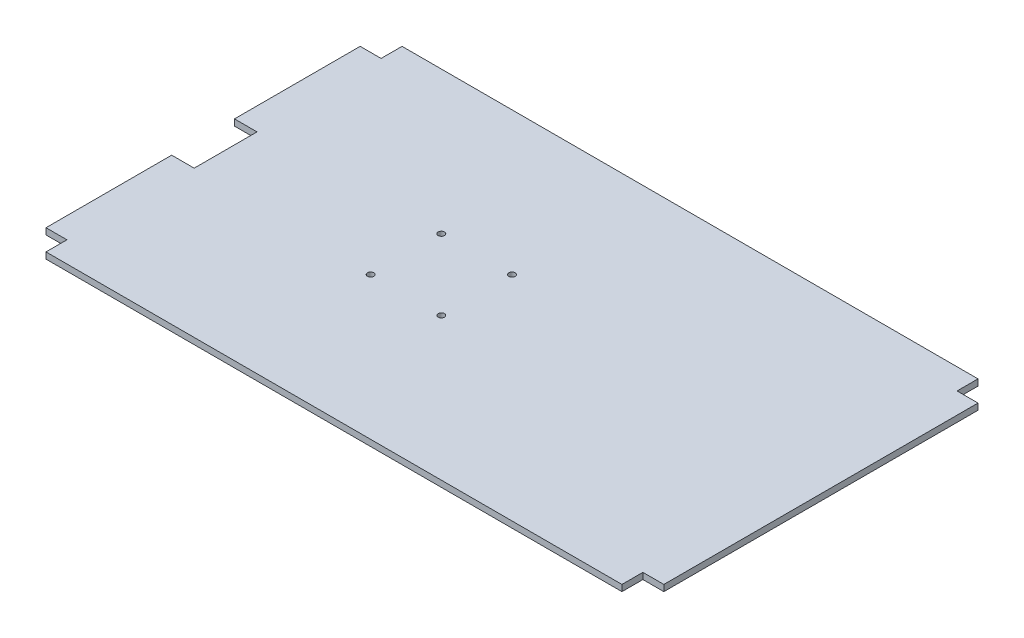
ISO-10303-21;
HEADER;
FILE_DESCRIPTION(('STEP AP214'),'2;1');
FILE_NAME('part.step','',(''),(''),'','','');
FILE_SCHEMA(('AUTOMOTIVE_DESIGN { 1 0 10303 214 1 1 1 1 }'));
ENDSEC;
DATA;
#1=APPLICATION_CONTEXT('core data for automotive mechanical design processes');
#2=APPLICATION_PROTOCOL_DEFINITION('international standard','automotive_design',2000,#1);
#3=PRODUCT_CONTEXT('',#1,'mechanical');
#4=PRODUCT('Part','Part','',(#3));
#5=PRODUCT_RELATED_PRODUCT_CATEGORY('part','',(#4));
#6=PRODUCT_DEFINITION_FORMATION('','',#4);
#7=PRODUCT_DEFINITION_CONTEXT('part definition',#1,'design');
#8=PRODUCT_DEFINITION('design','',#6,#7);
#9=PRODUCT_DEFINITION_SHAPE('','',#8);
#10=(LENGTH_UNIT() NAMED_UNIT(*) SI_UNIT(.MILLI.,.METRE.));
#11=(NAMED_UNIT(*) PLANE_ANGLE_UNIT() SI_UNIT($,.RADIAN.));
#12=(NAMED_UNIT(*) SI_UNIT($,.STERADIAN.) SOLID_ANGLE_UNIT());
#13=UNCERTAINTY_MEASURE_WITH_UNIT(LENGTH_MEASURE(1.E-05),#10,'distance_accuracy_value','');
#14=(GEOMETRIC_REPRESENTATION_CONTEXT(3) GLOBAL_UNCERTAINTY_ASSIGNED_CONTEXT((#13)) GLOBAL_UNIT_ASSIGNED_CONTEXT((#10,
#11,#12)) REPRESENTATION_CONTEXT('',''));
#15=CARTESIAN_POINT('',(0.,0.,0.));
#16=DIRECTION('',(0.,0.,1.));
#17=DIRECTION('',(1.,0.,0.));
#18=AXIS2_PLACEMENT_3D('',#15,#16,#17);
#19=CARTESIAN_POINT('',(-590.,6.,300.));
#20=DIRECTION('',(1.,0.,0.));
#21=DIRECTION('',(0.,0.,-1.));
#22=AXIS2_PLACEMENT_3D('',#19,#20,#21);
#23=PLANE('',#22);
#24=DIRECTION('',(0.,0.,1.));
#25=VECTOR('',#24,1.);
#26=CARTESIAN_POINT('',(-590.,-6.,300.));
#27=LINE('',#26,#25);
#28=CARTESIAN_POINT('',(-590.,-6.,-300.));
#29=VERTEX_POINT('',#28);
#30=CARTESIAN_POINT('',(-590.,-6.,-60.0000000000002));
#31=VERTEX_POINT('',#30);
#32=EDGE_CURVE('E193',#29,#31,#27,.T.);
#33=ORIENTED_EDGE('',*,*,#32,.T.);
#34=DIRECTION('',(0.,1.,0.));
#35=VECTOR('',#34,1.);
#36=CARTESIAN_POINT('',(-590.,-6.001,-60.0000000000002));
#37=LINE('',#36,#35);
#38=CARTESIAN_POINT('',(-590.,6.,-60.0000000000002));
#39=VERTEX_POINT('',#38);
#40=EDGE_CURVE('E269',#31,#39,#37,.T.);
#41=ORIENTED_EDGE('',*,*,#40,.T.);
#42=DIRECTION('',(0.,0.,1.));
#43=VECTOR('',#42,1.);
#44=CARTESIAN_POINT('',(-590.,6.,300.));
#45=LINE('',#44,#43);
#46=CARTESIAN_POINT('',(-590.,6.,-300.));
#47=VERTEX_POINT('',#46);
#48=EDGE_CURVE('E156',#47,#39,#45,.T.);
#49=ORIENTED_EDGE('',*,*,#48,.F.);
#50=DIRECTION('',(0.,-1.,0.));
#51=VECTOR('',#50,1.);
#52=CARTESIAN_POINT('',(-590.,6.,-300.));
#53=LINE('',#52,#51);
#54=EDGE_CURVE('E204',#47,#29,#53,.T.);
#55=ORIENTED_EDGE('',*,*,#54,.T.);
#56=EDGE_LOOP('',(#33,#41,#49,#55));
#57=FACE_BOUND('',#56,.T.);
#58=ADVANCED_FACE('F39',(#57),#23,.F.);
#59=CARTESIAN_POINT('',(550.,6.,340.));
#60=DIRECTION('',(-1.,0.,0.));
#61=DIRECTION('',(0.,0.,1.));
#62=AXIS2_PLACEMENT_3D('',#59,#60,#61);
#63=PLANE('',#62);
#64=DIRECTION('',(0.,0.,-1.));
#65=VECTOR('',#64,1.);
#66=CARTESIAN_POINT('',(550.,-6.,340.));
#67=LINE('',#66,#65);
#68=CARTESIAN_POINT('',(550.,-6.,340.));
#69=VERTEX_POINT('',#68);
#70=CARTESIAN_POINT('',(550.,-6.,300.));
#71=VERTEX_POINT('',#70);
#72=EDGE_CURVE('E174',#69,#71,#67,.T.);
#73=ORIENTED_EDGE('',*,*,#72,.T.);
#74=DIRECTION('',(0.,-1.,0.));
#75=VECTOR('',#74,1.);
#76=CARTESIAN_POINT('',(550.,6.,300.));
#77=LINE('',#76,#75);
#78=CARTESIAN_POINT('',(550.,6.,300.));
#79=VERTEX_POINT('',#78);
#80=EDGE_CURVE('E11',#79,#71,#77,.T.);
#81=ORIENTED_EDGE('',*,*,#80,.F.);
#82=DIRECTION('',(0.,0.,-1.));
#83=VECTOR('',#82,1.);
#84=CARTESIAN_POINT('',(550.,6.,340.));
#85=LINE('',#84,#83);
#86=CARTESIAN_POINT('',(550.,6.,340.));
#87=VERTEX_POINT('',#86);
#88=EDGE_CURVE('E200',#87,#79,#85,.T.);
#89=ORIENTED_EDGE('',*,*,#88,.F.);
#90=DIRECTION('',(0.,-1.,0.));
#91=VECTOR('',#90,1.);
#92=CARTESIAN_POINT('',(550.,6.,340.));
#93=LINE('',#92,#91);
#94=EDGE_CURVE('E170',#87,#69,#93,.T.);
#95=ORIENTED_EDGE('',*,*,#94,.T.);
#96=EDGE_LOOP('',(#73,#81,#89,#95));
#97=FACE_BOUND('',#96,.T.);
#98=ADVANCED_FACE('F41',(#97),#63,.F.);
#99=CARTESIAN_POINT('',(590.,6.,300.));
#100=DIRECTION('',(0.,0.,-1.));
#101=DIRECTION('',(-1.,0.,0.));
#102=AXIS2_PLACEMENT_3D('',#99,#100,#101);
#103=PLANE('',#102);
#104=DIRECTION('',(1.,0.,0.));
#105=VECTOR('',#104,1.);
#106=CARTESIAN_POINT('',(590.,-6.,300.));
#107=LINE('',#106,#105);
#108=CARTESIAN_POINT('',(590.,-6.,300.));
#109=VERTEX_POINT('',#108);
#110=EDGE_CURVE('E177',#71,#109,#107,.T.);
#111=ORIENTED_EDGE('',*,*,#110,.T.);
#112=DIRECTION('',(0.,-1.,0.));
#113=VECTOR('',#112,1.);
#114=CARTESIAN_POINT('',(590.,6.,300.));
#115=LINE('',#114,#113);
#116=CARTESIAN_POINT('',(590.,6.,300.));
#117=VERTEX_POINT('',#116);
#118=EDGE_CURVE('E47',#117,#109,#115,.T.);
#119=ORIENTED_EDGE('',*,*,#118,.F.);
#120=DIRECTION('',(1.,0.,0.));
#121=VECTOR('',#120,1.);
#122=CARTESIAN_POINT('',(590.,6.,300.));
#123=LINE('',#122,#121);
#124=EDGE_CURVE('E116',#79,#117,#123,.T.);
#125=ORIENTED_EDGE('',*,*,#124,.F.);
#126=ORIENTED_EDGE('',*,*,#80,.T.);
#127=EDGE_LOOP('',(#111,#119,#125,#126));
#128=FACE_BOUND('',#127,.T.);
#129=ADVANCED_FACE('F291',(#128),#103,.F.);
#130=CARTESIAN_POINT('',(590.,6.,300.));
#131=DIRECTION('',(-1.,0.,0.));
#132=DIRECTION('',(0.,0.,1.));
#133=AXIS2_PLACEMENT_3D('',#130,#131,#132);
#134=PLANE('',#133);
#135=DIRECTION('',(0.,0.,-1.));
#136=VECTOR('',#135,1.);
#137=CARTESIAN_POINT('',(590.,-6.,300.));
#138=LINE('',#137,#136);
#139=CARTESIAN_POINT('',(590.,-6.,-300.));
#140=VERTEX_POINT('',#139);
#141=EDGE_CURVE('E180',#109,#140,#138,.T.);
#142=ORIENTED_EDGE('',*,*,#141,.T.);
#143=DIRECTION('',(0.,-1.,0.));
#144=VECTOR('',#143,1.);
#145=CARTESIAN_POINT('',(590.,6.,-300.));
#146=LINE('',#145,#144);
#147=CARTESIAN_POINT('',(590.,6.,-300.));
#148=VERTEX_POINT('',#147);
#149=EDGE_CURVE('E219',#148,#140,#146,.T.);
#150=ORIENTED_EDGE('',*,*,#149,.F.);
#151=DIRECTION('',(0.,0.,-1.));
#152=VECTOR('',#151,1.);
#153=CARTESIAN_POINT('',(590.,6.,300.));
#154=LINE('',#153,#152);
#155=EDGE_CURVE('E227',#117,#148,#154,.T.);
#156=ORIENTED_EDGE('',*,*,#155,.F.);
#157=ORIENTED_EDGE('',*,*,#118,.T.);
#158=EDGE_LOOP('',(#142,#150,#156,#157));
#159=FACE_BOUND('',#158,.T.);
#160=ADVANCED_FACE('F225',(#159),#134,.F.);
#161=CARTESIAN_POINT('',(590.,6.,-300.));
#162=DIRECTION('',(0.,0.,1.));
#163=DIRECTION('',(1.,0.,0.));
#164=AXIS2_PLACEMENT_3D('',#161,#162,#163);
#165=PLANE('',#164);
#166=DIRECTION('',(-1.,0.,0.));
#167=VECTOR('',#166,1.);
#168=CARTESIAN_POINT('',(590.,-6.,-300.));
#169=LINE('',#168,#167);
#170=CARTESIAN_POINT('',(550.,-6.,-300.));
#171=VERTEX_POINT('',#170);
#172=EDGE_CURVE('E182',#140,#171,#169,.T.);
#173=ORIENTED_EDGE('',*,*,#172,.T.);
#174=DIRECTION('',(0.,-1.,0.));
#175=VECTOR('',#174,1.);
#176=CARTESIAN_POINT('',(550.,6.,-300.));
#177=LINE('',#176,#175);
#178=CARTESIAN_POINT('',(550.,6.,-300.));
#179=VERTEX_POINT('',#178);
#180=EDGE_CURVE('E216',#179,#171,#177,.T.);
#181=ORIENTED_EDGE('',*,*,#180,.F.);
#182=DIRECTION('',(-1.,0.,0.));
#183=VECTOR('',#182,1.);
#184=CARTESIAN_POINT('',(590.,6.,-300.));
#185=LINE('',#184,#183);
#186=EDGE_CURVE('E245',#148,#179,#185,.T.);
#187=ORIENTED_EDGE('',*,*,#186,.F.);
#188=ORIENTED_EDGE('',*,*,#149,.T.);
#189=EDGE_LOOP('',(#173,#181,#187,#188));
#190=FACE_BOUND('',#189,.T.);
#191=ADVANCED_FACE('F236',(#190),#165,.F.);
#192=CARTESIAN_POINT('',(550.,6.,-340.));
#193=DIRECTION('',(-1.,0.,0.));
#194=DIRECTION('',(0.,0.,1.));
#195=AXIS2_PLACEMENT_3D('',#192,#193,#194);
#196=PLANE('',#195);
#197=DIRECTION('',(0.,0.,-1.));
#198=VECTOR('',#197,1.);
#199=CARTESIAN_POINT('',(550.,-6.,-340.));
#200=LINE('',#199,#198);
#201=CARTESIAN_POINT('',(550.,-6.,-340.));
#202=VERTEX_POINT('',#201);
#203=EDGE_CURVE('E184',#171,#202,#200,.T.);
#204=ORIENTED_EDGE('',*,*,#203,.T.);
#205=DIRECTION('',(0.,-1.,0.));
#206=VECTOR('',#205,1.);
#207=CARTESIAN_POINT('',(550.,6.,-340.));
#208=LINE('',#207,#206);
#209=CARTESIAN_POINT('',(550.,6.,-340.));
#210=VERTEX_POINT('',#209);
#211=EDGE_CURVE('E213',#210,#202,#208,.T.);
#212=ORIENTED_EDGE('',*,*,#211,.F.);
#213=DIRECTION('',(0.,0.,-1.));
#214=VECTOR('',#213,1.);
#215=CARTESIAN_POINT('',(550.,6.,-340.));
#216=LINE('',#215,#214);
#217=EDGE_CURVE('E242',#179,#210,#216,.T.);
#218=ORIENTED_EDGE('',*,*,#217,.F.);
#219=ORIENTED_EDGE('',*,*,#180,.T.);
#220=EDGE_LOOP('',(#204,#212,#218,#219));
#221=FACE_BOUND('',#220,.T.);
#222=ADVANCED_FACE('F240',(#221),#196,.F.);
#223=CARTESIAN_POINT('',(-550.,6.,-340.));
#224=DIRECTION('',(0.,0.,1.));
#225=DIRECTION('',(1.,0.,0.));
#226=AXIS2_PLACEMENT_3D('',#223,#224,#225);
#227=PLANE('',#226);
#228=DIRECTION('',(-1.,0.,0.));
#229=VECTOR('',#228,1.);
#230=CARTESIAN_POINT('',(-550.,-6.,-340.));
#231=LINE('',#230,#229);
#232=CARTESIAN_POINT('',(-550.,-6.,-340.));
#233=VERTEX_POINT('',#232);
#234=EDGE_CURVE('E186',#202,#233,#231,.T.);
#235=ORIENTED_EDGE('',*,*,#234,.T.);
#236=DIRECTION('',(0.,-1.,0.));
#237=VECTOR('',#236,1.);
#238=CARTESIAN_POINT('',(-550.,6.,-340.));
#239=LINE('',#238,#237);
#240=CARTESIAN_POINT('',(-550.,6.,-340.));
#241=VERTEX_POINT('',#240);
#242=EDGE_CURVE('E210',#241,#233,#239,.T.);
#243=ORIENTED_EDGE('',*,*,#242,.F.);
#244=DIRECTION('',(-1.,0.,0.));
#245=VECTOR('',#244,1.);
#246=CARTESIAN_POINT('',(-550.,6.,-340.));
#247=LINE('',#246,#245);
#248=EDGE_CURVE('E244',#210,#241,#247,.T.);
#249=ORIENTED_EDGE('',*,*,#248,.F.);
#250=ORIENTED_EDGE('',*,*,#211,.T.);
#251=EDGE_LOOP('',(#235,#243,#249,#250));
#252=FACE_BOUND('',#251,.T.);
#253=ADVANCED_FACE('F510',(#252),#227,.F.);
#254=CARTESIAN_POINT('',(-550.,6.,-340.));
#255=DIRECTION('',(1.,0.,0.));
#256=DIRECTION('',(0.,0.,-1.));
#257=AXIS2_PLACEMENT_3D('',#254,#255,#256);
#258=PLANE('',#257);
#259=DIRECTION('',(0.,0.,1.));
#260=VECTOR('',#259,1.);
#261=CARTESIAN_POINT('',(-550.,-6.,-340.));
#262=LINE('',#261,#260);
#263=CARTESIAN_POINT('',(-550.,-6.,-300.));
#264=VERTEX_POINT('',#263);
#265=EDGE_CURVE('E188',#233,#264,#262,.T.);
#266=ORIENTED_EDGE('',*,*,#265,.T.);
#267=DIRECTION('',(0.,-1.,0.));
#268=VECTOR('',#267,1.);
#269=CARTESIAN_POINT('',(-550.,6.,-300.));
#270=LINE('',#269,#268);
#271=CARTESIAN_POINT('',(-550.,6.,-300.));
#272=VERTEX_POINT('',#271);
#273=EDGE_CURVE('E207',#272,#264,#270,.T.);
#274=ORIENTED_EDGE('',*,*,#273,.F.);
#275=DIRECTION('',(0.,0.,1.));
#276=VECTOR('',#275,1.);
#277=CARTESIAN_POINT('',(-550.,6.,-340.));
#278=LINE('',#277,#276);
#279=EDGE_CURVE('E247',#241,#272,#278,.T.);
#280=ORIENTED_EDGE('',*,*,#279,.F.);
#281=ORIENTED_EDGE('',*,*,#242,.T.);
#282=EDGE_LOOP('',(#266,#274,#280,#281));
#283=FACE_BOUND('',#282,.T.);
#284=ADVANCED_FACE('F314',(#283),#258,.F.);
#285=CARTESIAN_POINT('',(-590.,6.,-300.));
#286=DIRECTION('',(0.,0.,1.));
#287=DIRECTION('',(1.,0.,0.));
#288=AXIS2_PLACEMENT_3D('',#285,#286,#287);
#289=PLANE('',#288);
#290=DIRECTION('',(-1.,0.,0.));
#291=VECTOR('',#290,1.);
#292=CARTESIAN_POINT('',(-590.,-6.,-300.));
#293=LINE('',#292,#291);
#294=EDGE_CURVE('E190',#264,#29,#293,.T.);
#295=ORIENTED_EDGE('',*,*,#294,.T.);
#296=ORIENTED_EDGE('',*,*,#54,.F.);
#297=DIRECTION('',(-1.,0.,0.));
#298=VECTOR('',#297,1.);
#299=CARTESIAN_POINT('',(-590.,6.,-300.));
#300=LINE('',#299,#298);
#301=EDGE_CURVE('E253',#272,#47,#300,.T.);
#302=ORIENTED_EDGE('',*,*,#301,.F.);
#303=ORIENTED_EDGE('',*,*,#273,.T.);
#304=EDGE_LOOP('',(#295,#296,#302,#303));
#305=FACE_BOUND('',#304,.T.);
#306=ADVANCED_FACE('F307',(#305),#289,.F.);
#307=CARTESIAN_POINT('',(-590.,6.,59.9999999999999));
#308=VERTEX_POINT('',#307);
#309=CARTESIAN_POINT('',(-590.,6.,300.));
#310=VERTEX_POINT('',#309);
#311=EDGE_CURVE('E152',#308,#310,#45,.T.);
#312=ORIENTED_EDGE('',*,*,#311,.F.);
#313=DIRECTION('',(0.,1.,0.));
#314=VECTOR('',#313,1.);
#315=CARTESIAN_POINT('',(-590.,-6.001,59.9999999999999));
#316=LINE('',#315,#314);
#317=CARTESIAN_POINT('',(-590.,-6.,59.9999999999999));
#318=VERTEX_POINT('',#317);
#319=EDGE_CURVE('E284',#318,#308,#316,.T.);
#320=ORIENTED_EDGE('',*,*,#319,.F.);
#321=CARTESIAN_POINT('',(-590.,-6.,300.));
#322=VERTEX_POINT('',#321);
#323=EDGE_CURVE('E192',#318,#322,#27,.T.);
#324=ORIENTED_EDGE('',*,*,#323,.T.);
#325=DIRECTION('',(0.,-1.,0.));
#326=VECTOR('',#325,1.);
#327=CARTESIAN_POINT('',(-590.,6.,300.));
#328=LINE('',#327,#326);
#329=EDGE_CURVE('E165',#310,#322,#328,.T.);
#330=ORIENTED_EDGE('',*,*,#329,.F.);
#331=EDGE_LOOP('',(#312,#320,#324,#330));
#332=FACE_BOUND('',#331,.T.);
#333=ADVANCED_FACE('F300',(#332),#23,.F.);
#334=CARTESIAN_POINT('',(-590.,6.,300.));
#335=DIRECTION('',(0.,0.,-1.));
#336=DIRECTION('',(-1.,0.,0.));
#337=AXIS2_PLACEMENT_3D('',#334,#335,#336);
#338=PLANE('',#337);
#339=DIRECTION('',(1.,0.,0.));
#340=VECTOR('',#339,1.);
#341=CARTESIAN_POINT('',(-590.,-6.,300.));
#342=LINE('',#341,#340);
#343=CARTESIAN_POINT('',(-550.,-6.,300.));
#344=VERTEX_POINT('',#343);
#345=EDGE_CURVE('E162',#322,#344,#342,.T.);
#346=ORIENTED_EDGE('',*,*,#345,.T.);
#347=DIRECTION('',(0.,-1.,0.));
#348=VECTOR('',#347,1.);
#349=CARTESIAN_POINT('',(-550.,6.,300.));
#350=LINE('',#349,#348);
#351=CARTESIAN_POINT('',(-550.,6.,300.));
#352=VERTEX_POINT('',#351);
#353=EDGE_CURVE('E159',#352,#344,#350,.T.);
#354=ORIENTED_EDGE('',*,*,#353,.F.);
#355=DIRECTION('',(1.,0.,0.));
#356=VECTOR('',#355,1.);
#357=CARTESIAN_POINT('',(-590.,6.,300.));
#358=LINE('',#357,#356);
#359=EDGE_CURVE('E143',#310,#352,#358,.T.);
#360=ORIENTED_EDGE('',*,*,#359,.F.);
#361=ORIENTED_EDGE('',*,*,#329,.T.);
#362=EDGE_LOOP('',(#346,#354,#360,#361));
#363=FACE_BOUND('',#362,.T.);
#364=ADVANCED_FACE('F160',(#363),#338,.F.);
#365=CARTESIAN_POINT('',(-550.,6.,340.));
#366=DIRECTION('',(1.,0.,0.));
#367=DIRECTION('',(0.,0.,-1.));
#368=AXIS2_PLACEMENT_3D('',#365,#366,#367);
#369=PLANE('',#368);
#370=DIRECTION('',(0.,0.,1.));
#371=VECTOR('',#370,1.);
#372=CARTESIAN_POINT('',(-550.,-6.,340.));
#373=LINE('',#372,#371);
#374=CARTESIAN_POINT('',(-550.,-6.,340.));
#375=VERTEX_POINT('',#374);
#376=EDGE_CURVE('E197',#344,#375,#373,.T.);
#377=ORIENTED_EDGE('',*,*,#376,.T.);
#378=DIRECTION('',(0.,-1.,0.));
#379=VECTOR('',#378,1.);
#380=CARTESIAN_POINT('',(-550.,6.,340.));
#381=LINE('',#380,#379);
#382=CARTESIAN_POINT('',(-550.,6.,340.));
#383=VERTEX_POINT('',#382);
#384=EDGE_CURVE('E166',#383,#375,#381,.T.);
#385=ORIENTED_EDGE('',*,*,#384,.F.);
#386=DIRECTION('',(0.,0.,1.));
#387=VECTOR('',#386,1.);
#388=CARTESIAN_POINT('',(-550.,6.,340.));
#389=LINE('',#388,#387);
#390=EDGE_CURVE('E148',#352,#383,#389,.T.);
#391=ORIENTED_EDGE('',*,*,#390,.F.);
#392=ORIENTED_EDGE('',*,*,#353,.T.);
#393=EDGE_LOOP('',(#377,#385,#391,#392));
#394=FACE_BOUND('',#393,.T.);
#395=ADVANCED_FACE('F168',(#394),#369,.F.);
#396=CARTESIAN_POINT('',(-550.,6.,340.));
#397=DIRECTION('',(0.,0.,-1.));
#398=DIRECTION('',(-1.,0.,0.));
#399=AXIS2_PLACEMENT_3D('',#396,#397,#398);
#400=PLANE('',#399);
#401=DIRECTION('',(1.,0.,0.));
#402=VECTOR('',#401,1.);
#403=CARTESIAN_POINT('',(-550.,-6.,340.));
#404=LINE('',#403,#402);
#405=EDGE_CURVE('E108',#375,#69,#404,.T.);
#406=ORIENTED_EDGE('',*,*,#405,.T.);
#407=ORIENTED_EDGE('',*,*,#94,.F.);
#408=DIRECTION('',(1.,0.,0.));
#409=VECTOR('',#408,1.);
#410=CARTESIAN_POINT('',(-550.,6.,340.));
#411=LINE('',#410,#409);
#412=EDGE_CURVE('E63',#383,#87,#411,.T.);
#413=ORIENTED_EDGE('',*,*,#412,.F.);
#414=ORIENTED_EDGE('',*,*,#384,.T.);
#415=EDGE_LOOP('',(#406,#407,#413,#414));
#416=FACE_BOUND('',#415,.T.);
#417=ADVANCED_FACE('F358',(#416),#400,.F.);
#418=CARTESIAN_POINT('',(0.,6.,0.));
#419=DIRECTION('',(0.,1.,0.));
#420=DIRECTION('',(0.,0.,1.));
#421=AXIS2_PLACEMENT_3D('',#418,#419,#420);
#422=PLANE('',#421);
#423=CARTESIAN_POINT('',(-202.500015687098,6.,-67.5000000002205));
#424=DIRECTION('',(0.,1.,0.));
#425=DIRECTION('',(0.,0.,1.));
#426=AXIS2_PLACEMENT_3D('',#423,#424,#425);
#427=CIRCLE('',#426,6.00000000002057);
#428=CARTESIAN_POINT('',(-202.500015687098,6.,-61.5000000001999));
#429=VERTEX_POINT('',#428);
#430=EDGE_CURVE('E451',#429,#429,#427,.T.);
#431=ORIENTED_EDGE('',*,*,#430,.F.);
#432=EDGE_LOOP('',(#431));
#433=FACE_BOUND('',#432,.T.);
#434=CARTESIAN_POINT('',(-67.500015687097,6.,67.4999999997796));
#435=DIRECTION('',(0.,1.,0.));
#436=DIRECTION('',(0.,0.,1.));
#437=AXIS2_PLACEMENT_3D('',#434,#435,#436);
#438=CIRCLE('',#437,6.0000000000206);
#439=CARTESIAN_POINT('',(-67.500015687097,6.,73.4999999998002));
#440=VERTEX_POINT('',#439);
#441=EDGE_CURVE('E461',#440,#440,#438,.T.);
#442=ORIENTED_EDGE('',*,*,#441,.F.);
#443=EDGE_LOOP('',(#442));
#444=FACE_BOUND('',#443,.T.);
#445=CARTESIAN_POINT('',(-67.500015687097,6.,-67.5000000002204));
#446=DIRECTION('',(0.,1.,0.));
#447=DIRECTION('',(0.,0.,1.));
#448=AXIS2_PLACEMENT_3D('',#445,#446,#447);
#449=CIRCLE('',#448,6.0000000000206);
#450=CARTESIAN_POINT('',(-67.500015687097,6.,-61.5000000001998));
#451=VERTEX_POINT('',#450);
#452=EDGE_CURVE('E476',#451,#451,#449,.T.);
#453=ORIENTED_EDGE('',*,*,#452,.F.);
#454=EDGE_LOOP('',(#453));
#455=FACE_BOUND('',#454,.T.);
#456=CARTESIAN_POINT('',(-202.500015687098,6.,67.4999999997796));
#457=DIRECTION('',(0.,1.,0.));
#458=DIRECTION('',(0.,0.,1.));
#459=AXIS2_PLACEMENT_3D('',#456,#457,#458);
#460=CIRCLE('',#459,6.0000000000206);
#461=CARTESIAN_POINT('',(-202.500015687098,6.,73.4999999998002));
#462=VERTEX_POINT('',#461);
#463=EDGE_CURVE('E338',#462,#462,#460,.T.);
#464=ORIENTED_EDGE('',*,*,#463,.F.);
#465=EDGE_LOOP('',(#464));
#466=FACE_BOUND('',#465,.T.);
#467=DIRECTION('',(-1.,0.,0.));
#468=VECTOR('',#467,1.);
#469=CARTESIAN_POINT('',(-590.,6.,-60.0000000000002));
#470=LINE('',#469,#468);
#471=CARTESIAN_POINT('',(-547.,6.,-60.0000000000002));
#472=VERTEX_POINT('',#471);
#473=EDGE_CURVE('E260',#472,#39,#470,.T.);
#474=ORIENTED_EDGE('',*,*,#473,.F.);
#475=DIRECTION('',(0.,0.,-1.));
#476=VECTOR('',#475,1.);
#477=CARTESIAN_POINT('',(-547.,6.,59.9999999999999));
#478=LINE('',#477,#476);
#479=CARTESIAN_POINT('',(-547.,6.,59.9999999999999));
#480=VERTEX_POINT('',#479);
#481=EDGE_CURVE('E329',#480,#472,#478,.T.);
#482=ORIENTED_EDGE('',*,*,#481,.F.);
#483=DIRECTION('',(1.,0.,0.));
#484=VECTOR('',#483,1.);
#485=CARTESIAN_POINT('',(-590.,6.,59.9999999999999));
#486=LINE('',#485,#484);
#487=EDGE_CURVE('E332',#308,#480,#486,.T.);
#488=ORIENTED_EDGE('',*,*,#487,.F.);
#489=ORIENTED_EDGE('',*,*,#311,.T.);
#490=ORIENTED_EDGE('',*,*,#359,.T.);
#491=ORIENTED_EDGE('',*,*,#390,.T.);
#492=ORIENTED_EDGE('',*,*,#412,.T.);
#493=ORIENTED_EDGE('',*,*,#88,.T.);
#494=ORIENTED_EDGE('',*,*,#124,.T.);
#495=ORIENTED_EDGE('',*,*,#155,.T.);
#496=ORIENTED_EDGE('',*,*,#186,.T.);
#497=ORIENTED_EDGE('',*,*,#217,.T.);
#498=ORIENTED_EDGE('',*,*,#248,.T.);
#499=ORIENTED_EDGE('',*,*,#279,.T.);
#500=ORIENTED_EDGE('',*,*,#301,.T.);
#501=ORIENTED_EDGE('',*,*,#48,.T.);
#502=EDGE_LOOP('',(#474,#482,#488,#489,#490,#491,#492,#493,#494,#495,#496,#497,#498,#499,#500,#501));
#503=FACE_BOUND('',#502,.T.);
#504=ADVANCED_FACE('F146',(#433,#444,#455,#466,#503),#422,.T.);
#505=CARTESIAN_POINT('',(0.,-6.,0.));
#506=DIRECTION('',(0.,1.,0.));
#507=DIRECTION('',(0.,0.,1.));
#508=AXIS2_PLACEMENT_3D('',#505,#506,#507);
#509=PLANE('',#508);
#510=CARTESIAN_POINT('',(-202.500015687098,-6.,-67.5000000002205));
#511=DIRECTION('',(0.,1.,0.));
#512=DIRECTION('',(0.,0.,1.));
#513=AXIS2_PLACEMENT_3D('',#510,#511,#512);
#514=CIRCLE('',#513,6.00000000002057);
#515=CARTESIAN_POINT('',(-202.500015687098,-6.,-61.5000000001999));
#516=VERTEX_POINT('',#515);
#517=EDGE_CURVE('E454',#516,#516,#514,.F.);
#518=ORIENTED_EDGE('',*,*,#517,.F.);
#519=EDGE_LOOP('',(#518));
#520=FACE_BOUND('',#519,.T.);
#521=CARTESIAN_POINT('',(-67.500015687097,-6.,67.4999999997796));
#522=DIRECTION('',(0.,1.,0.));
#523=DIRECTION('',(0.,0.,1.));
#524=AXIS2_PLACEMENT_3D('',#521,#522,#523);
#525=CIRCLE('',#524,6.0000000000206);
#526=CARTESIAN_POINT('',(-67.500015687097,-6.,73.4999999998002));
#527=VERTEX_POINT('',#526);
#528=EDGE_CURVE('E457',#527,#527,#525,.F.);
#529=ORIENTED_EDGE('',*,*,#528,.F.);
#530=EDGE_LOOP('',(#529));
#531=FACE_BOUND('',#530,.T.);
#532=CARTESIAN_POINT('',(-67.500015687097,-6.,-67.5000000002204));
#533=DIRECTION('',(0.,1.,0.));
#534=DIRECTION('',(0.,0.,1.));
#535=AXIS2_PLACEMENT_3D('',#532,#533,#534);
#536=CIRCLE('',#535,6.0000000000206);
#537=CARTESIAN_POINT('',(-67.500015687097,-6.,-61.5000000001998));
#538=VERTEX_POINT('',#537);
#539=EDGE_CURVE('E464',#538,#538,#536,.F.);
#540=ORIENTED_EDGE('',*,*,#539,.F.);
#541=EDGE_LOOP('',(#540));
#542=FACE_BOUND('',#541,.T.);
#543=CARTESIAN_POINT('',(-202.500015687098,-6.,67.4999999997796));
#544=DIRECTION('',(0.,1.,0.));
#545=DIRECTION('',(0.,0.,1.));
#546=AXIS2_PLACEMENT_3D('',#543,#544,#545);
#547=CIRCLE('',#546,6.0000000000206);
#548=CARTESIAN_POINT('',(-202.500015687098,-6.,73.4999999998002));
#549=VERTEX_POINT('',#548);
#550=EDGE_CURVE('E335',#549,#549,#547,.F.);
#551=ORIENTED_EDGE('',*,*,#550,.F.);
#552=EDGE_LOOP('',(#551));
#553=FACE_BOUND('',#552,.T.);
#554=DIRECTION('',(0.,0.,1.));
#555=VECTOR('',#554,1.);
#556=CARTESIAN_POINT('',(-547.,-6.,59.9999999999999));
#557=LINE('',#556,#555);
#558=CARTESIAN_POINT('',(-547.,-6.,-60.0000000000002));
#559=VERTEX_POINT('',#558);
#560=CARTESIAN_POINT('',(-547.,-6.,59.9999999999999));
#561=VERTEX_POINT('',#560);
#562=EDGE_CURVE('E54',#559,#561,#557,.T.);
#563=ORIENTED_EDGE('',*,*,#562,.F.);
#564=DIRECTION('',(1.,0.,0.));
#565=VECTOR('',#564,1.);
#566=CARTESIAN_POINT('',(-590.,-6.,-60.0000000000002));
#567=LINE('',#566,#565);
#568=EDGE_CURVE('E330',#31,#559,#567,.T.);
#569=ORIENTED_EDGE('',*,*,#568,.F.);
#570=ORIENTED_EDGE('',*,*,#32,.F.);
#571=ORIENTED_EDGE('',*,*,#294,.F.);
#572=ORIENTED_EDGE('',*,*,#265,.F.);
#573=ORIENTED_EDGE('',*,*,#234,.F.);
#574=ORIENTED_EDGE('',*,*,#203,.F.);
#575=ORIENTED_EDGE('',*,*,#172,.F.);
#576=ORIENTED_EDGE('',*,*,#141,.F.);
#577=ORIENTED_EDGE('',*,*,#110,.F.);
#578=ORIENTED_EDGE('',*,*,#72,.F.);
#579=ORIENTED_EDGE('',*,*,#405,.F.);
#580=ORIENTED_EDGE('',*,*,#376,.F.);
#581=ORIENTED_EDGE('',*,*,#345,.F.);
#582=ORIENTED_EDGE('',*,*,#323,.F.);
#583=DIRECTION('',(-1.,0.,0.));
#584=VECTOR('',#583,1.);
#585=CARTESIAN_POINT('',(-590.,-6.,59.9999999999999));
#586=LINE('',#585,#584);
#587=EDGE_CURVE('E178',#561,#318,#586,.T.);
#588=ORIENTED_EDGE('',*,*,#587,.F.);
#589=EDGE_LOOP('',(#563,#569,#570,#571,#572,#573,#574,#575,#576,#577,#578,#579,#580,#581,#582,#588));
#590=FACE_BOUND('',#589,.T.);
#591=ADVANCED_FACE('F230',(#520,#531,#542,#553,#590),#509,.F.);
#592=CARTESIAN_POINT('',(-590.,-6.001,-60.0000000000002));
#593=DIRECTION('',(0.,0.,-1.));
#594=DIRECTION('',(-1.,0.,0.));
#595=AXIS2_PLACEMENT_3D('',#592,#593,#594);
#596=PLANE('',#595);
#597=ORIENTED_EDGE('',*,*,#568,.T.);
#598=DIRECTION('',(0.,1.,0.));
#599=VECTOR('',#598,1.);
#600=CARTESIAN_POINT('',(-547.,-6.001,-60.0000000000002));
#601=LINE('',#600,#599);
#602=EDGE_CURVE('E273',#559,#472,#601,.T.);
#603=ORIENTED_EDGE('',*,*,#602,.T.);
#604=ORIENTED_EDGE('',*,*,#473,.T.);
#605=ORIENTED_EDGE('',*,*,#40,.F.);
#606=EDGE_LOOP('',(#597,#603,#604,#605));
#607=FACE_BOUND('',#606,.T.);
#608=ADVANCED_FACE('F331',(#607),#596,.F.);
#609=CARTESIAN_POINT('',(-547.,-6.001,59.9999999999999));
#610=DIRECTION('',(1.,0.,0.));
#611=DIRECTION('',(0.,0.,-1.));
#612=AXIS2_PLACEMENT_3D('',#609,#610,#611);
#613=PLANE('',#612);
#614=ORIENTED_EDGE('',*,*,#562,.T.);
#615=DIRECTION('',(0.,1.,0.));
#616=VECTOR('',#615,1.);
#617=CARTESIAN_POINT('',(-547.,-6.001,59.9999999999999));
#618=LINE('',#617,#616);
#619=EDGE_CURVE('E278',#561,#480,#618,.T.);
#620=ORIENTED_EDGE('',*,*,#619,.T.);
#621=ORIENTED_EDGE('',*,*,#481,.T.);
#622=ORIENTED_EDGE('',*,*,#602,.F.);
#623=EDGE_LOOP('',(#614,#620,#621,#622));
#624=FACE_BOUND('',#623,.T.);
#625=ADVANCED_FACE('F328',(#624),#613,.F.);
#626=CARTESIAN_POINT('',(-590.,-6.001,59.9999999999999));
#627=DIRECTION('',(0.,0.,1.));
#628=DIRECTION('',(1.,0.,0.));
#629=AXIS2_PLACEMENT_3D('',#626,#627,#628);
#630=PLANE('',#629);
#631=ORIENTED_EDGE('',*,*,#587,.T.);
#632=ORIENTED_EDGE('',*,*,#319,.T.);
#633=ORIENTED_EDGE('',*,*,#487,.T.);
#634=ORIENTED_EDGE('',*,*,#619,.F.);
#635=EDGE_LOOP('',(#631,#632,#633,#634));
#636=FACE_BOUND('',#635,.T.);
#637=ADVANCED_FACE('F342',(#636),#630,.F.);
#638=CARTESIAN_POINT('',(-202.500015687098,-6.001,67.4999999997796));
#639=DIRECTION('',(0.,1.,0.));
#640=DIRECTION('',(0.,0.,1.));
#641=AXIS2_PLACEMENT_3D('',#638,#639,#640);
#642=CYLINDRICAL_SURFACE('',#641,6.0000000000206);
#643=ORIENTED_EDGE('',*,*,#463,.T.);
#644=EDGE_LOOP('',(#643));
#645=FACE_BOUND('',#644,.T.);
#646=ORIENTED_EDGE('',*,*,#550,.T.);
#647=EDGE_LOOP('',(#646));
#648=FACE_BOUND('',#647,.T.);
#649=ADVANCED_FACE('F344',(#645,#648),#642,.F.);
#650=CARTESIAN_POINT('',(-67.500015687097,-6.001,-67.5000000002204));
#651=DIRECTION('',(0.,1.,0.));
#652=DIRECTION('',(0.,0.,1.));
#653=AXIS2_PLACEMENT_3D('',#650,#651,#652);
#654=CYLINDRICAL_SURFACE('',#653,6.0000000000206);
#655=ORIENTED_EDGE('',*,*,#452,.T.);
#656=EDGE_LOOP('',(#655));
#657=FACE_BOUND('',#656,.T.);
#658=ORIENTED_EDGE('',*,*,#539,.T.);
#659=EDGE_LOOP('',(#658));
#660=FACE_BOUND('',#659,.T.);
#661=ADVANCED_FACE('F350',(#657,#660),#654,.F.);
#662=CARTESIAN_POINT('',(-67.500015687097,-6.001,67.4999999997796));
#663=DIRECTION('',(0.,1.,0.));
#664=DIRECTION('',(0.,0.,1.));
#665=AXIS2_PLACEMENT_3D('',#662,#663,#664);
#666=CYLINDRICAL_SURFACE('',#665,6.0000000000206);
#667=ORIENTED_EDGE('',*,*,#441,.T.);
#668=EDGE_LOOP('',(#667));
#669=FACE_BOUND('',#668,.T.);
#670=ORIENTED_EDGE('',*,*,#528,.T.);
#671=EDGE_LOOP('',(#670));
#672=FACE_BOUND('',#671,.T.);
#673=ADVANCED_FACE('F419',(#669,#672),#666,.F.);
#674=CARTESIAN_POINT('',(-202.500015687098,-6.001,-67.5000000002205));
#675=DIRECTION('',(0.,1.,0.));
#676=DIRECTION('',(0.,0.,1.));
#677=AXIS2_PLACEMENT_3D('',#674,#675,#676);
#678=CYLINDRICAL_SURFACE('',#677,6.00000000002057);
#679=ORIENTED_EDGE('',*,*,#430,.T.);
#680=EDGE_LOOP('',(#679));
#681=FACE_BOUND('',#680,.T.);
#682=ORIENTED_EDGE('',*,*,#517,.T.);
#683=EDGE_LOOP('',(#682));
#684=FACE_BOUND('',#683,.T.);
#685=ADVANCED_FACE('F430',(#681,#684),#678,.F.);
#686=CLOSED_SHELL('',(#58,#98,#129,#160,#191,#222,#253,#284,#306,#333,#364,#395,#417,#504,#591,
#608,#625,#637,#649,#661,#673,#685));
#687=MANIFOLD_SOLID_BREP('B2',#686);
#688=ADVANCED_BREP_SHAPE_REPRESENTATION('',(#18,#687),#14);
#689=SHAPE_DEFINITION_REPRESENTATION(#9,#688);
ENDSEC;
END-ISO-10303-21;
